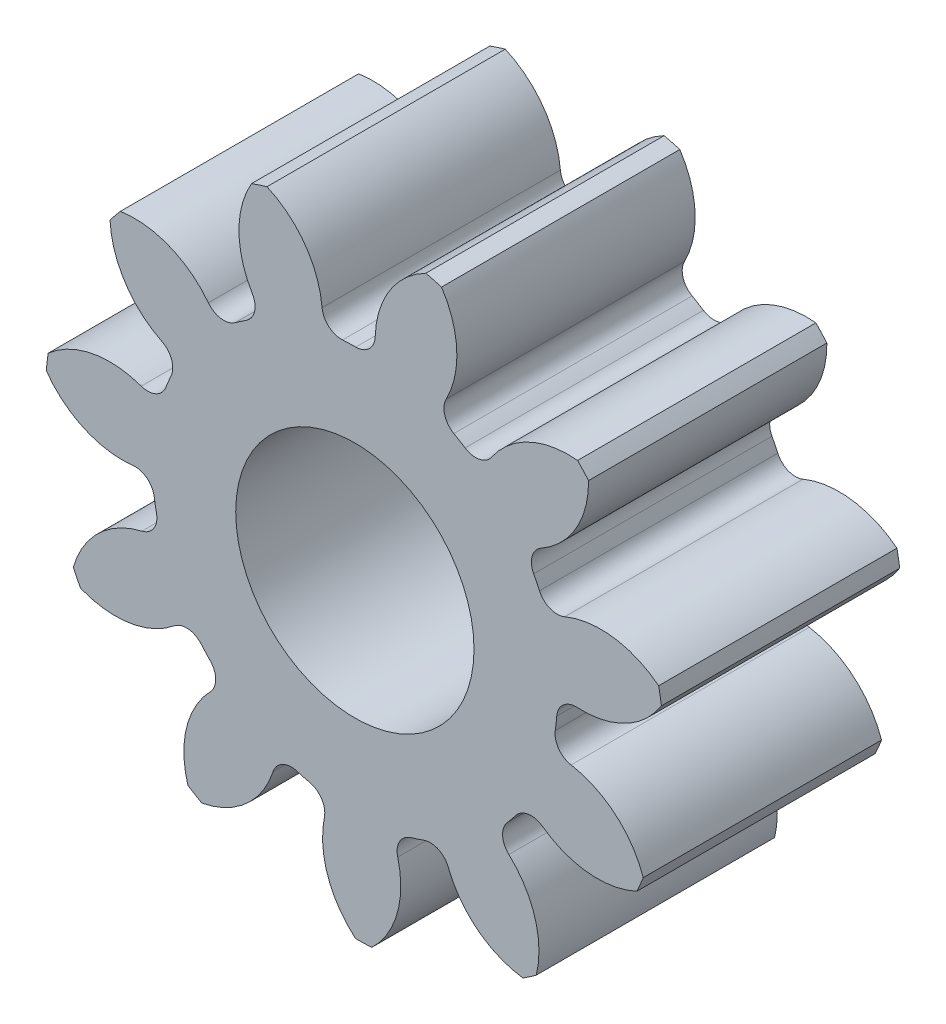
from build123d import *

# Parameters (mm, degrees)
SKETCH3_R         = 132.08
GEARBODY_DEPTH    = 101.6
TOOTHCUT_DEPTH    = 213.63304729
CIRPATTERN1_COUNT = 11
BOREDIA_R         = 50.8
BORE_DEPTH        = 12700


with BuildPart() as part:
    # Sketch3 → gearBody (new body)
    with BuildSketch(Plane.XY):
        Circle(SKETCH3_R)
    extrude(amount=GEARBODY_DEPTH)

    # Sketch2 → toothCut (cut, through all)
    with BuildSketch(Plane.XY):
        with BuildLine():
            ThreePointArc((85.428135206, -12.652403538), (85.794246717, -9.868983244), (86.069693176, -7.075133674))
            ThreePointArc((86.069693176, -7.075133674), (88.883046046, -1.513940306), (94.779516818, 0.504340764))
            ThreePointArc((94.779516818, 0.504340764), (116.487866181, 5.531339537), (132.08, 21.450149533))
            ThreePointArc((132.08, 21.450149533), (132.933839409, -15.291489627), (123.759846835, -50.879618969))
            ThreePointArc((123.759846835, -50.879618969), (112.189438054, -31.836279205), (92.189496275, -22.011541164))
            ThreePointArc((92.189496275, -22.011541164), (86.90529822, -18.707138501), (85.428135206, -12.652403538))
        make_face()
    toothcut = extrude(amount=TOOTHCUT_DEPTH, mode=Mode.SUBTRACT)

    # CirPattern1: toothCut ×11 about axis
    cirpattern1_axis = Axis((0, 0, 0), (0, 0, 1))
    for i in range(1, CIRPATTERN1_COUNT):
        add(toothcut.rotate(cirpattern1_axis, i * 360 / CIRPATTERN1_COUNT), mode=Mode.SUBTRACT)

    # boreDia → bore (cut, symmetric)
    with BuildSketch(Plane.XY):
        Circle(BOREDIA_R)
    extrude(amount=BORE_DEPTH, both=True, mode=Mode.SUBTRACT)


solid = part.part
